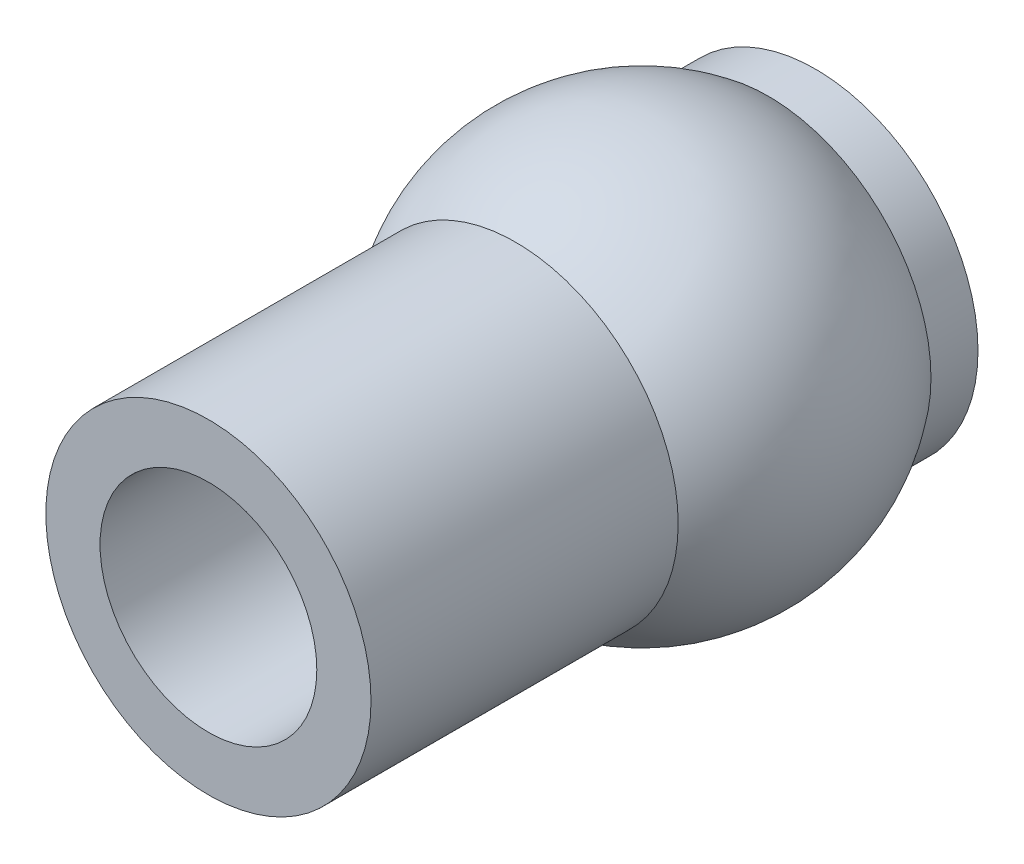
ISO-10303-21;
HEADER;
FILE_DESCRIPTION(('STEP AP214'),'2;1');
FILE_NAME('part.step','',(''),(''),'','','');
FILE_SCHEMA(('AUTOMOTIVE_DESIGN { 1 0 10303 214 1 1 1 1 }'));
ENDSEC;
DATA;
#1=APPLICATION_CONTEXT('core data for automotive mechanical design processes');
#2=APPLICATION_PROTOCOL_DEFINITION('international standard','automotive_design',2000,#1);
#3=PRODUCT_CONTEXT('',#1,'mechanical');
#4=PRODUCT('Part','Part','',(#3));
#5=PRODUCT_RELATED_PRODUCT_CATEGORY('part','',(#4));
#6=PRODUCT_DEFINITION_FORMATION('','',#4);
#7=PRODUCT_DEFINITION_CONTEXT('part definition',#1,'design');
#8=PRODUCT_DEFINITION('design','',#6,#7);
#9=PRODUCT_DEFINITION_SHAPE('','',#8);
#10=(LENGTH_UNIT() NAMED_UNIT(*) SI_UNIT(.MILLI.,.METRE.));
#11=(NAMED_UNIT(*) PLANE_ANGLE_UNIT() SI_UNIT($,.RADIAN.));
#12=(NAMED_UNIT(*) SI_UNIT($,.STERADIAN.) SOLID_ANGLE_UNIT());
#13=UNCERTAINTY_MEASURE_WITH_UNIT(LENGTH_MEASURE(1.E-05),#10,'distance_accuracy_value','');
#14=(GEOMETRIC_REPRESENTATION_CONTEXT(3) GLOBAL_UNCERTAINTY_ASSIGNED_CONTEXT((#13)) GLOBAL_UNIT_ASSIGNED_CONTEXT((#10,
#11,#12)) REPRESENTATION_CONTEXT('',''));
#15=CARTESIAN_POINT('',(0.,0.,0.));
#16=DIRECTION('',(0.,0.,1.));
#17=DIRECTION('',(1.,0.,0.));
#18=AXIS2_PLACEMENT_3D('',#15,#16,#17);
#19=CARTESIAN_POINT('',(0.,0.,-2.032));
#20=DIRECTION('',(0.,0.,1.));
#21=DIRECTION('',(1.,0.,0.));
#22=AXIS2_PLACEMENT_3D('',#19,#20,#21);
#23=CYLINDRICAL_SURFACE('',#22,1.905);
#24=CARTESIAN_POINT('',(0.,0.,1.48106178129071));
#25=DIRECTION('',(0.,0.,-1.));
#26=DIRECTION('',(-1.,0.,0.));
#27=AXIS2_PLACEMENT_3D('',#24,#25,#26);
#28=CIRCLE('',#27,1.905);
#29=CARTESIAN_POINT('',(-1.905,0.,1.48106178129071));
#30=VERTEX_POINT('',#29);
#31=EDGE_CURVE('E10',#30,#30,#28,.F.);
#32=ORIENTED_EDGE('',*,*,#31,.T.);
#33=EDGE_LOOP('',(#32));
#34=FACE_BOUND('',#33,.T.);
#35=CARTESIAN_POINT('',(0.,0.,5.08));
#36=DIRECTION('',(0.,0.,1.));
#37=DIRECTION('',(1.,0.,0.));
#38=AXIS2_PLACEMENT_3D('',#35,#36,#37);
#39=CIRCLE('',#38,1.905);
#40=CARTESIAN_POINT('',(1.905,0.,5.08));
#41=VERTEX_POINT('',#40);
#42=EDGE_CURVE('E51',#41,#41,#39,.T.);
#43=ORIENTED_EDGE('',*,*,#42,.F.);
#44=EDGE_LOOP('',(#43));
#45=FACE_BOUND('',#44,.T.);
#46=ADVANCED_FACE('F31',(#34,#45),#23,.T.);
#47=CARTESIAN_POINT('',(0.,0.,5.08));
#48=DIRECTION('',(0.,0.,1.));
#49=DIRECTION('',(1.,0.,0.));
#50=AXIS2_PLACEMENT_3D('',#47,#48,#49);
#51=PLANE('',#50);
#52=CARTESIAN_POINT('',(0.,0.,5.08));
#53=DIRECTION('',(0.,0.,1.));
#54=DIRECTION('',(1.,0.,0.));
#55=AXIS2_PLACEMENT_3D('',#52,#53,#54);
#56=CIRCLE('',#55,1.27);
#57=CARTESIAN_POINT('',(1.27,0.,5.08));
#58=VERTEX_POINT('',#57);
#59=EDGE_CURVE('E54',#58,#58,#56,.T.);
#60=ORIENTED_EDGE('',*,*,#59,.F.);
#61=EDGE_LOOP('',(#60));
#62=FACE_BOUND('',#61,.T.);
#63=ORIENTED_EDGE('',*,*,#42,.T.);
#64=EDGE_LOOP('',(#63));
#65=FACE_BOUND('',#64,.T.);
#66=ADVANCED_FACE('F80',(#62,#65),#51,.T.);
#67=CARTESIAN_POINT('',(0.,0.,0.));
#68=DIRECTION('',(0.,1.,0.));
#69=DIRECTION('',(1.,0.,0.));
#70=AXIS2_PLACEMENT_3D('',#67,#68,#69);
#71=SPHERICAL_SURFACE('',#70,2.413);
#72=CARTESIAN_POINT('',(0.,0.,0.));
#73=DIRECTION('',(0.,0.,-1.));
#74=DIRECTION('',(-1.,0.,0.));
#75=AXIS2_PLACEMENT_3D('',#72,#73,#74);
#76=SPHERICAL_SURFACE('',#75,2.413);
#77=ORIENTED_EDGE('',*,*,#31,.F.);
#78=EDGE_LOOP('',(#77));
#79=FACE_BOUND('',#78,.T.);
#80=CARTESIAN_POINT('',(0.,0.,-1.48106178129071));
#81=DIRECTION('',(0.,0.,1.));
#82=DIRECTION('',(1.,0.,0.));
#83=AXIS2_PLACEMENT_3D('',#80,#81,#82);
#84=CIRCLE('',#83,1.905);
#85=CARTESIAN_POINT('',(1.905,0.,-1.48106178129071));
#86=VERTEX_POINT('',#85);
#87=EDGE_CURVE('E39',#86,#86,#84,.F.);
#88=ORIENTED_EDGE('',*,*,#87,.F.);
#89=EDGE_LOOP('',(#88));
#90=FACE_BOUND('',#89,.T.);
#91=ADVANCED_FACE('F33',(#79,#90),#76,.T.);
#92=CARTESIAN_POINT('',(0.,0.,-2.032));
#93=DIRECTION('',(0.,0.,1.));
#94=DIRECTION('',(1.,0.,0.));
#95=AXIS2_PLACEMENT_3D('',#92,#93,#94);
#96=PLANE('',#95);
#97=CARTESIAN_POINT('',(0.,0.,-2.032));
#98=DIRECTION('',(0.,0.,1.));
#99=DIRECTION('',(1.,0.,0.));
#100=AXIS2_PLACEMENT_3D('',#97,#98,#99);
#101=CIRCLE('',#100,1.30136274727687);
#102=CARTESIAN_POINT('',(1.30136274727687,0.,-2.032));
#103=VERTEX_POINT('',#102);
#104=EDGE_CURVE('E43',#103,#103,#101,.F.);
#105=ORIENTED_EDGE('',*,*,#104,.F.);
#106=EDGE_LOOP('',(#105));
#107=FACE_BOUND('',#106,.T.);
#108=CARTESIAN_POINT('',(0.,0.,-2.032));
#109=DIRECTION('',(0.,0.,1.));
#110=DIRECTION('',(1.,0.,0.));
#111=AXIS2_PLACEMENT_3D('',#108,#109,#110);
#112=CIRCLE('',#111,1.905);
#113=CARTESIAN_POINT('',(1.905,0.,-2.032));
#114=VERTEX_POINT('',#113);
#115=EDGE_CURVE('E48',#114,#114,#112,.T.);
#116=ORIENTED_EDGE('',*,*,#115,.F.);
#117=EDGE_LOOP('',(#116));
#118=FACE_BOUND('',#117,.T.);
#119=ADVANCED_FACE('F69',(#107,#118),#96,.F.);
#120=ORIENTED_EDGE('',*,*,#87,.T.);
#121=EDGE_LOOP('',(#120));
#122=FACE_BOUND('',#121,.T.);
#123=ORIENTED_EDGE('',*,*,#115,.T.);
#124=EDGE_LOOP('',(#123));
#125=FACE_BOUND('',#124,.T.);
#126=ADVANCED_FACE('F66',(#122,#125),#23,.T.);
#127=CARTESIAN_POINT('',(0.,0.,0.));
#128=DIRECTION('',(0.,0.,1.));
#129=DIRECTION('',(1.,0.,0.));
#130=AXIS2_PLACEMENT_3D('',#127,#128,#129);
#131=SPHERICAL_SURFACE('',#130,2.413);
#132=CARTESIAN_POINT('',(0.,0.,-2.05174779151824));
#133=DIRECTION('',(0.,0.,1.));
#134=DIRECTION('',(1.,0.,0.));
#135=AXIS2_PLACEMENT_3D('',#132,#133,#134);
#136=CIRCLE('',#135,1.27);
#137=CARTESIAN_POINT('',(1.27,0.,-2.05174779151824));
#138=VERTEX_POINT('',#137);
#139=EDGE_CURVE('E35',#138,#138,#136,.F.);
#140=ORIENTED_EDGE('',*,*,#139,.F.);
#141=EDGE_LOOP('',(#140));
#142=FACE_BOUND('',#141,.T.);
#143=ORIENTED_EDGE('',*,*,#104,.T.);
#144=EDGE_LOOP('',(#143));
#145=FACE_BOUND('',#144,.T.);
#146=ADVANCED_FACE('F63',(#142,#145),#131,.T.);
#147=CARTESIAN_POINT('',(0.,0.,-2.413));
#148=DIRECTION('',(0.,0.,1.));
#149=DIRECTION('',(1.,0.,0.));
#150=AXIS2_PLACEMENT_3D('',#147,#148,#149);
#151=CYLINDRICAL_SURFACE('',#150,1.27);
#152=ORIENTED_EDGE('',*,*,#139,.T.);
#153=EDGE_LOOP('',(#152));
#154=FACE_BOUND('',#153,.T.);
#155=ORIENTED_EDGE('',*,*,#59,.T.);
#156=EDGE_LOOP('',(#155));
#157=FACE_BOUND('',#156,.T.);
#158=ADVANCED_FACE('F61',(#154,#157),#151,.F.);
#159=CLOSED_SHELL('',(#46,#66,#91,#119,#126,#146,#158));
#160=MANIFOLD_SOLID_BREP('B2',#159);
#161=ADVANCED_BREP_SHAPE_REPRESENTATION('',(#18,#160),#14);
#162=SHAPE_DEFINITION_REPRESENTATION(#9,#161);
ENDSEC;
END-ISO-10303-21;
